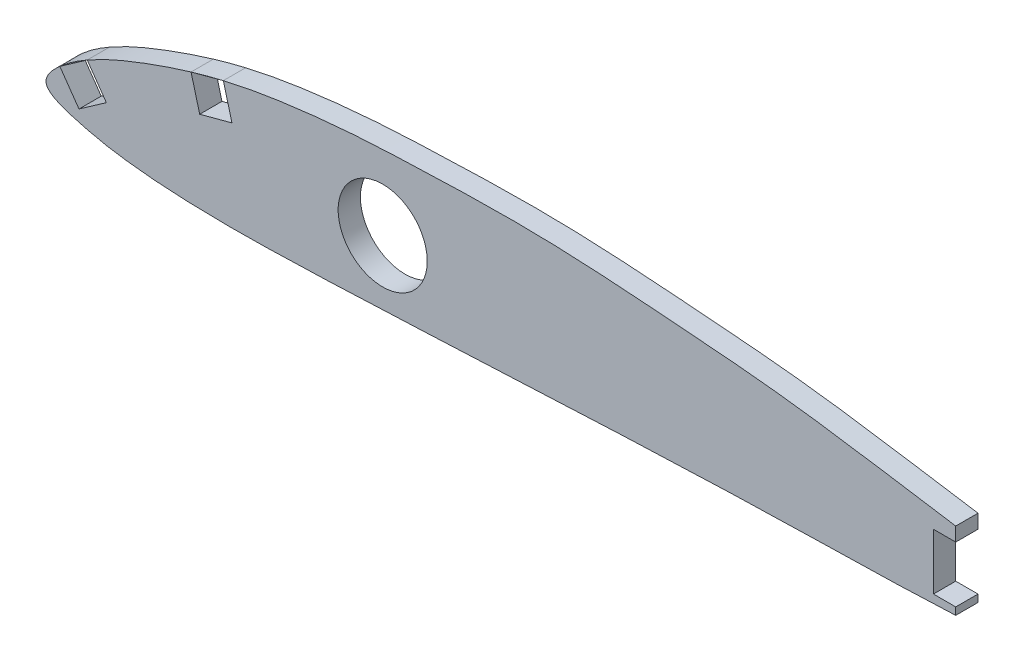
ISO-10303-21;
HEADER;
FILE_DESCRIPTION(('STEP AP214'),'2;1');
FILE_NAME('part.step','',(''),(''),'','','');
FILE_SCHEMA(('AUTOMOTIVE_DESIGN { 1 0 10303 214 1 1 1 1 }'));
ENDSEC;
DATA;
#1=APPLICATION_CONTEXT('core data for automotive mechanical design processes');
#2=APPLICATION_PROTOCOL_DEFINITION('international standard','automotive_design',2000,#1);
#3=PRODUCT_CONTEXT('',#1,'mechanical');
#4=PRODUCT('Part','Part','',(#3));
#5=PRODUCT_RELATED_PRODUCT_CATEGORY('part','',(#4));
#6=PRODUCT_DEFINITION_FORMATION('','',#4);
#7=PRODUCT_DEFINITION_CONTEXT('part definition',#1,'design');
#8=PRODUCT_DEFINITION('design','',#6,#7);
#9=PRODUCT_DEFINITION_SHAPE('','',#8);
#10=(LENGTH_UNIT() NAMED_UNIT(*) SI_UNIT(.MILLI.,.METRE.));
#11=(NAMED_UNIT(*) PLANE_ANGLE_UNIT() SI_UNIT($,.RADIAN.));
#12=(NAMED_UNIT(*) SI_UNIT($,.STERADIAN.) SOLID_ANGLE_UNIT());
#13=UNCERTAINTY_MEASURE_WITH_UNIT(LENGTH_MEASURE(1.E-05),#10,'distance_accuracy_value','');
#14=(GEOMETRIC_REPRESENTATION_CONTEXT(3) GLOBAL_UNCERTAINTY_ASSIGNED_CONTEXT((#13)) GLOBAL_UNIT_ASSIGNED_CONTEXT((#10,
#11,#12)) REPRESENTATION_CONTEXT('',''));
#15=CARTESIAN_POINT('',(0.,0.,0.));
#16=DIRECTION('',(0.,0.,1.));
#17=DIRECTION('',(1.,0.,0.));
#18=AXIS2_PLACEMENT_3D('',#15,#16,#17);
#19=CARTESIAN_POINT('',(0.,0.,0.));
#20=DIRECTION('',(0.,0.,-1.));
#21=DIRECTION('',(-1.,0.,0.));
#22=AXIS2_PLACEMENT_3D('',#19,#20,#21);
#23=PLANE('',#22);
#24=DIRECTION('',(0.,1.,0.));
#25=VECTOR('',#24,1.);
#26=CARTESIAN_POINT('',(129.677,0.,0.));
#27=LINE('',#26,#25);
#28=CARTESIAN_POINT('',(129.677,8.,0.));
#29=VERTEX_POINT('',#28);
#30=CARTESIAN_POINT('',(129.677,9.98356933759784,0.));
#31=VERTEX_POINT('',#30);
#32=EDGE_CURVE('E201',#29,#31,#27,.T.);
#33=ORIENTED_EDGE('',*,*,#32,.F.);
#34=DIRECTION('',(1.,0.,0.));
#35=VECTOR('',#34,1.);
#36=CARTESIAN_POINT('',(0.,8.,0.));
#37=LINE('',#36,#35);
#38=CARTESIAN_POINT('',(126.502,8.,0.));
#39=VERTEX_POINT('',#38);
#40=EDGE_CURVE('E64',#39,#29,#37,.T.);
#41=ORIENTED_EDGE('',*,*,#40,.F.);
#42=DIRECTION('',(0.,1.,0.));
#43=VECTOR('',#42,1.);
#44=CARTESIAN_POINT('',(126.502,0.,0.));
#45=LINE('',#44,#43);
#46=CARTESIAN_POINT('',(126.502,0.,0.));
#47=VERTEX_POINT('',#46);
#48=EDGE_CURVE('E190',#47,#39,#45,.T.);
#49=ORIENTED_EDGE('',*,*,#48,.F.);
#50=DIRECTION('',(-1.,0.,0.));
#51=VECTOR('',#50,1.);
#52=CARTESIAN_POINT('',(0.,1.79044563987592E-12,0.));
#53=LINE('',#52,#51);
#54=CARTESIAN_POINT('',(129.677,0.,0.));
#55=VERTEX_POINT('',#54);
#56=EDGE_CURVE('E133',#55,#47,#53,.T.);
#57=ORIENTED_EDGE('',*,*,#56,.F.);
#58=DIRECTION('',(0.,1.,0.));
#59=VECTOR('',#58,1.);
#60=CARTESIAN_POINT('',(129.677,4.98066869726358E-13,0.));
#61=LINE('',#60,#59);
#62=CARTESIAN_POINT('',(129.677,-1.04598156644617,0.));
#63=VERTEX_POINT('',#62);
#64=EDGE_CURVE('E196',#63,#55,#61,.T.);
#65=ORIENTED_EDGE('',*,*,#64,.F.);
#66=CARTESIAN_POINT('',(0.,0.,0.));
#67=CARTESIAN_POINT('',(-0.0484859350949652,0.941572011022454,0.));
#68=CARTESIAN_POINT('',(2.00754185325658,3.05522473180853,0.));
#69=CARTESIAN_POINT('',(4.92773606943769,5.1466904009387,0.));
#70=CARTESIAN_POINT('',(8.71252519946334,7.18476470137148,0.));
#71=CARTESIAN_POINT('',(15.9605352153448,10.1330490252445,0.));
#72=CARTESIAN_POINT('',(24.7528002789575,12.9382608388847,0.));
#73=CARTESIAN_POINT('',(35.1603546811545,14.6026126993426,0.));
#74=CARTESIAN_POINT('',(43.9813608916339,15.482919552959,0.));
#75=CARTESIAN_POINT('',(55.7229834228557,15.9750117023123,0.));
#76=CARTESIAN_POINT('',(70.4147838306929,16.391713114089,0.));
#77=CARTESIAN_POINT('',(87.9987880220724,15.1575928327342,0.));
#78=CARTESIAN_POINT('',(105.709747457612,13.7775565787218,0.));
#79=CARTESIAN_POINT('',(123.018830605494,11.0047737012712,0.));
#80=CARTESIAN_POINT('',(141.586795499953,8.1661867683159,0.));
#81=CARTESIAN_POINT('',(155.757184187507,4.83253050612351,0.));
#82=CARTESIAN_POINT('',(185.921370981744,-1.14244799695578,0.));
#83=CARTESIAN_POINT('',(146.891999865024,0.232259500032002,0.));
#84=CARTESIAN_POINT('',(129.919049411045,-1.3210353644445,0.));
#85=CARTESIAN_POINT('',(93.2790253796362,-1.89862445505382,0.));
#86=CARTESIAN_POINT('',(64.6376421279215,-3.45926123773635,0.));
#87=CARTESIAN_POINT('',(35.1487926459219,-4.74465237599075,0.));
#88=CARTESIAN_POINT('',(20.656598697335,-4.98228356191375,0.));
#89=CARTESIAN_POINT('',(9.98964050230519,-3.94915635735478,0.));
#90=CARTESIAN_POINT('',(4.55925202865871,-2.70750189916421,0.));
#91=CARTESIAN_POINT('',(0.0665353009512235,-1.29208144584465,0.));
#92=CARTESIAN_POINT('',(0.,0.,0.));
#93=B_SPLINE_CURVE_WITH_KNOTS('',3,(#66,#67,#68,#69,#70,#71,#72,#73,#74,#75,#76,#77,#78,#79,#80,
#81,#82,#83,#84,#85,#86,#87,#88,#89,#90,#91,#92),.UNSPECIFIED.,.T.,.F.,(4,1,1,1,1,1,1,1,1,1,1,1,
1,1,1,1,1,1,1,1,1,1,1,1,4),(0.,0.0105604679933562,0.0182111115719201,0.0322098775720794,
0.0455249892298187,0.0840694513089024,0.10897429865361,0.133649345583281,0.158232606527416,
0.207343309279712,0.25652270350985,0.30582635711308,0.355445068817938,0.40521420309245,
0.4553904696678,0.506006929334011,0.555121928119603,0.653369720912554,0.702490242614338,
0.849938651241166,0.899083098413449,0.948194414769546,0.972905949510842,0.985508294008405,1.),.UNSPECIFIED.);
#94=CARTESIAN_POINT('',(1.97152640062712,2.87928848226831,0.));
#95=VERTEX_POINT('',#94);
#96=EDGE_CURVE('E205',#63,#95,#93,.T.);
#97=ORIENTED_EDGE('',*,*,#96,.T.);
#98=DIRECTION('',(-0.573576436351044,0.819152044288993,0.));
#99=VECTOR('',#98,1.);
#100=CARTESIAN_POINT('',(2.67573714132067,1.87357131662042,0.));
#101=LINE('',#100,#99);
#102=CARTESIAN_POINT('',(4.70318417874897,-1.02192312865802,0.));
#103=VERTEX_POINT('',#102);
#104=EDGE_CURVE('E159',#103,#95,#101,.T.);
#105=ORIENTED_EDGE('',*,*,#104,.F.);
#106=DIRECTION('',(-0.819152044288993,-0.573576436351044,0.));
#107=VECTOR('',#106,1.);
#108=CARTESIAN_POINT('',(2.0274470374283,-2.89549444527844,0.));
#109=LINE('',#108,#107);
#110=CARTESIAN_POINT('',(8.60439578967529,1.70973464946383,0.));
#111=VERTEX_POINT('',#110);
#112=EDGE_CURVE('E248',#111,#103,#109,.T.);
#113=ORIENTED_EDGE('',*,*,#112,.F.);
#114=DIRECTION('',(0.573576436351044,-0.819152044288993,0.));
#115=VECTOR('',#114,1.);
#116=CARTESIAN_POINT('',(6.576948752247,4.60522909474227,0.));
#117=LINE('',#116,#115);
#118=CARTESIAN_POINT('',(5.87273801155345,5.61094626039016,0.));
#119=VERTEX_POINT('',#118);
#120=EDGE_CURVE('E179',#119,#111,#117,.T.);
#121=ORIENTED_EDGE('',*,*,#120,.F.);
#122=CARTESIAN_POINT('',(20.6768350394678,11.5336665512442,0.));
#123=VERTEX_POINT('',#122);
#124=EDGE_CURVE('E210',#119,#123,#93,.T.);
#125=ORIENTED_EDGE('',*,*,#124,.T.);
#126=DIRECTION('',(-0.258819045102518,0.965925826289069,0.));
#127=VECTOR('',#126,1.);
#128=CARTESIAN_POINT('',(22.1751663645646,5.94181791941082,0.));
#129=LINE('',#128,#127);
#130=CARTESIAN_POINT('',(21.9094607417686,6.93344480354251,0.));
#131=VERTEX_POINT('',#130);
#132=EDGE_CURVE('E237',#131,#123,#129,.T.);
#133=ORIENTED_EDGE('',*,*,#132,.F.);
#134=DIRECTION('',(-0.965925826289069,-0.258819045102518,0.));
#135=VECTOR('',#134,1.);
#136=CARTESIAN_POINT('',(-0.265705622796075,0.991626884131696,0.));
#137=LINE('',#136,#135);
#138=CARTESIAN_POINT('',(26.5096824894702,8.16607050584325,0.));
#139=VERTEX_POINT('',#138);
#140=EDGE_CURVE('E252',#139,#131,#137,.T.);
#141=ORIENTED_EDGE('',*,*,#140,.F.);
#142=DIRECTION('',(0.258819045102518,-0.965925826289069,0.));
#143=VECTOR('',#142,1.);
#144=CARTESIAN_POINT('',(26.7753881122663,7.17444362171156,0.));
#145=LINE('',#144,#143);
#146=CARTESIAN_POINT('',(25.2770567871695,12.7662922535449,0.));
#147=VERTEX_POINT('',#146);
#148=EDGE_CURVE('E261',#147,#139,#145,.T.);
#149=ORIENTED_EDGE('',*,*,#148,.F.);
#150=EDGE_CURVE('E211',#147,#31,#93,.T.);
#151=ORIENTED_EDGE('',*,*,#150,.T.);
#152=EDGE_LOOP('',(#33,#41,#49,#57,#65,#97,#105,#113,#121,#125,#133,#141,#149,#151));
#153=FACE_BOUND('',#152,.T.);
#154=CARTESIAN_POINT('',(47.995,5.,0.));
#155=DIRECTION('',(0.,0.,-1.));
#156=DIRECTION('',(-1.,0.,0.));
#157=AXIS2_PLACEMENT_3D('',#154,#155,#156);
#158=CIRCLE('',#157,6.35);
#159=CARTESIAN_POINT('',(41.645,5.,0.));
#160=VERTEX_POINT('',#159);
#161=EDGE_CURVE('E238',#160,#160,#158,.T.);
#162=ORIENTED_EDGE('',*,*,#161,.F.);
#163=EDGE_LOOP('',(#162));
#164=FACE_BOUND('',#163,.T.);
#165=ADVANCED_FACE('F44',(#153,#164),#23,.T.);
#166=CARTESIAN_POINT('',(0.,0.,3.175));
#167=DIRECTION('',(0.,0.,-1.));
#168=DIRECTION('',(-1.,0.,0.));
#169=AXIS2_PLACEMENT_3D('',#166,#167,#168);
#170=PLANE('',#169);
#171=CARTESIAN_POINT('',(47.995,5.,3.175));
#172=DIRECTION('',(0.,0.,1.));
#173=DIRECTION('',(1.,0.,0.));
#174=AXIS2_PLACEMENT_3D('',#171,#172,#173);
#175=CIRCLE('',#174,6.35);
#176=CARTESIAN_POINT('',(54.345,5.,3.175));
#177=VERTEX_POINT('',#176);
#178=EDGE_CURVE('E235',#177,#177,#175,.T.);
#179=ORIENTED_EDGE('',*,*,#178,.F.);
#180=EDGE_LOOP('',(#179));
#181=FACE_BOUND('',#180,.T.);
#182=DIRECTION('',(-1.,0.,0.));
#183=VECTOR('',#182,1.);
#184=CARTESIAN_POINT('',(126.502,8.,3.175));
#185=LINE('',#184,#183);
#186=CARTESIAN_POINT('',(129.677,8.,3.175));
#187=VERTEX_POINT('',#186);
#188=CARTESIAN_POINT('',(126.502,8.,3.175));
#189=VERTEX_POINT('',#188);
#190=EDGE_CURVE('E13',#187,#189,#185,.T.);
#191=ORIENTED_EDGE('',*,*,#190,.F.);
#192=DIRECTION('',(0.,-1.,0.));
#193=VECTOR('',#192,1.);
#194=CARTESIAN_POINT('',(129.677,23.6320828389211,3.175));
#195=LINE('',#194,#193);
#196=CARTESIAN_POINT('',(129.677,9.98356933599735,3.175));
#197=VERTEX_POINT('',#196);
#198=EDGE_CURVE('E200',#197,#187,#195,.T.);
#199=ORIENTED_EDGE('',*,*,#198,.F.);
#200=CARTESIAN_POINT('',(0.,0.,3.175));
#201=CARTESIAN_POINT('',(-0.0484859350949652,0.941572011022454,3.175));
#202=CARTESIAN_POINT('',(2.00754185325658,3.05522473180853,3.175));
#203=CARTESIAN_POINT('',(4.92773606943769,5.1466904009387,3.175));
#204=CARTESIAN_POINT('',(8.71252519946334,7.18476470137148,3.175));
#205=CARTESIAN_POINT('',(15.9605352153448,10.1330490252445,3.175));
#206=CARTESIAN_POINT('',(24.7528002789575,12.9382608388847,3.175));
#207=CARTESIAN_POINT('',(35.1603546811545,14.6026126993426,3.175));
#208=CARTESIAN_POINT('',(43.9813608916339,15.482919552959,3.175));
#209=CARTESIAN_POINT('',(55.7229834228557,15.9750117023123,3.175));
#210=CARTESIAN_POINT('',(70.4147838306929,16.391713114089,3.175));
#211=CARTESIAN_POINT('',(87.9987880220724,15.1575928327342,3.175));
#212=CARTESIAN_POINT('',(105.709747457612,13.7775565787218,3.175));
#213=CARTESIAN_POINT('',(123.018830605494,11.0047737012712,3.175));
#214=CARTESIAN_POINT('',(141.586795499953,8.1661867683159,3.175));
#215=CARTESIAN_POINT('',(155.757184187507,4.83253050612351,3.175));
#216=CARTESIAN_POINT('',(185.921370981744,-1.14244799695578,3.175));
#217=CARTESIAN_POINT('',(146.891999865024,0.232259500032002,3.175));
#218=CARTESIAN_POINT('',(129.919049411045,-1.3210353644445,3.175));
#219=CARTESIAN_POINT('',(93.2790253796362,-1.89862445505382,3.175));
#220=CARTESIAN_POINT('',(64.6376421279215,-3.45926123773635,3.175));
#221=CARTESIAN_POINT('',(35.1487926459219,-4.74465237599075,3.175));
#222=CARTESIAN_POINT('',(20.656598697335,-4.98228356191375,3.175));
#223=CARTESIAN_POINT('',(9.98964050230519,-3.94915635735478,3.175));
#224=CARTESIAN_POINT('',(4.55925202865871,-2.70750189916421,3.175));
#225=CARTESIAN_POINT('',(0.0665353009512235,-1.29208144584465,3.175));
#226=CARTESIAN_POINT('',(0.,0.,3.175));
#227=B_SPLINE_CURVE_WITH_KNOTS('',3,(#200,#201,#202,#203,#204,#205,#206,#207,#208,#209,#210,
#211,#212,#213,#214,#215,#216,#217,#218,#219,#220,#221,#222,#223,#224,#225,#226),.UNSPECIFIED.,
.T.,.F.,(4,1,1,1,1,1,1,1,1,1,1,1,1,1,1,1,1,1,1,1,1,1,1,1,4),(0.,0.0105604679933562,
0.0182111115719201,0.0322098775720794,0.0455249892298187,0.0840694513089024,0.10897429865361,
0.133649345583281,0.158232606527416,0.207343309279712,0.25652270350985,0.30582635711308,
0.355445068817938,0.40521420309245,0.4553904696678,0.506006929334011,0.555121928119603,
0.653369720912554,0.702490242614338,0.849938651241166,0.899083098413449,0.948194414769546,
0.972905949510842,0.985508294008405,1.),.UNSPECIFIED.);
#228=CARTESIAN_POINT('',(25.2770567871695,12.7662922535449,3.175));
#229=VERTEX_POINT('',#228);
#230=EDGE_CURVE('E172',#229,#197,#227,.T.);
#231=ORIENTED_EDGE('',*,*,#230,.F.);
#232=DIRECTION('',(-0.258819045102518,0.965925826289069,0.));
#233=VECTOR('',#232,1.);
#234=CARTESIAN_POINT('',(25.2770567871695,12.7662922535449,3.175));
#235=LINE('',#234,#233);
#236=CARTESIAN_POINT('',(26.5096824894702,8.16607050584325,3.175));
#237=VERTEX_POINT('',#236);
#238=EDGE_CURVE('E255',#237,#229,#235,.T.);
#239=ORIENTED_EDGE('',*,*,#238,.F.);
#240=DIRECTION('',(0.965925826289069,0.258819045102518,0.));
#241=VECTOR('',#240,1.);
#242=CARTESIAN_POINT('',(21.9094607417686,6.93344480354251,3.175));
#243=LINE('',#242,#241);
#244=CARTESIAN_POINT('',(21.9094607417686,6.93344480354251,3.175));
#245=VERTEX_POINT('',#244);
#246=EDGE_CURVE('E259',#245,#237,#243,.T.);
#247=ORIENTED_EDGE('',*,*,#246,.F.);
#248=DIRECTION('',(0.258819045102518,-0.965925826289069,0.));
#249=VECTOR('',#248,1.);
#250=CARTESIAN_POINT('',(20.6768350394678,11.5336665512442,3.175));
#251=LINE('',#250,#249);
#252=CARTESIAN_POINT('',(20.6768350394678,11.5336665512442,3.175));
#253=VERTEX_POINT('',#252);
#254=EDGE_CURVE('E264',#253,#245,#251,.T.);
#255=ORIENTED_EDGE('',*,*,#254,.F.);
#256=CARTESIAN_POINT('',(5.87273819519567,5.61094636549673,3.175));
#257=VERTEX_POINT('',#256);
#258=EDGE_CURVE('E173',#257,#253,#227,.T.);
#259=ORIENTED_EDGE('',*,*,#258,.F.);
#260=DIRECTION('',(-0.573576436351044,0.819152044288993,0.));
#261=VECTOR('',#260,1.);
#262=CARTESIAN_POINT('',(5.87273801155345,5.61094626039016,3.175));
#263=LINE('',#262,#261);
#264=CARTESIAN_POINT('',(8.60439578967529,1.70973464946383,3.175));
#265=VERTEX_POINT('',#264);
#266=EDGE_CURVE('E251',#265,#257,#263,.T.);
#267=ORIENTED_EDGE('',*,*,#266,.F.);
#268=DIRECTION('',(0.819152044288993,0.573576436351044,0.));
#269=VECTOR('',#268,1.);
#270=CARTESIAN_POINT('',(4.70318417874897,-1.02192312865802,3.175));
#271=LINE('',#270,#269);
#272=CARTESIAN_POINT('',(4.70318417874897,-1.02192312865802,3.175));
#273=VERTEX_POINT('',#272);
#274=EDGE_CURVE('E178',#273,#265,#271,.T.);
#275=ORIENTED_EDGE('',*,*,#274,.F.);
#276=DIRECTION('',(0.573576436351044,-0.819152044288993,0.));
#277=VECTOR('',#276,1.);
#278=CARTESIAN_POINT('',(1.97152640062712,2.87928848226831,3.175));
#279=LINE('',#278,#277);
#280=CARTESIAN_POINT('',(1.97152640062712,2.87928848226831,3.175));
#281=VERTEX_POINT('',#280);
#282=EDGE_CURVE('E156',#281,#273,#279,.T.);
#283=ORIENTED_EDGE('',*,*,#282,.F.);
#284=CARTESIAN_POINT('',(129.677,-1.04598156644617,3.175));
#285=VERTEX_POINT('',#284);
#286=EDGE_CURVE('E166',#285,#281,#227,.T.);
#287=ORIENTED_EDGE('',*,*,#286,.F.);
#288=DIRECTION('',(0.,-1.,0.));
#289=VECTOR('',#288,1.);
#290=CARTESIAN_POINT('',(129.677,0.,3.175));
#291=LINE('',#290,#289);
#292=CARTESIAN_POINT('',(129.677,0.,3.175));
#293=VERTEX_POINT('',#292);
#294=EDGE_CURVE('E195',#293,#285,#291,.T.);
#295=ORIENTED_EDGE('',*,*,#294,.F.);
#296=DIRECTION('',(1.,0.,0.));
#297=VECTOR('',#296,1.);
#298=CARTESIAN_POINT('',(126.502,0.,3.175));
#299=LINE('',#298,#297);
#300=CARTESIAN_POINT('',(126.502,0.,3.175));
#301=VERTEX_POINT('',#300);
#302=EDGE_CURVE('E192',#301,#293,#299,.T.);
#303=ORIENTED_EDGE('',*,*,#302,.F.);
#304=DIRECTION('',(0.,-1.,0.));
#305=VECTOR('',#304,1.);
#306=CARTESIAN_POINT('',(126.502,8.,3.175));
#307=LINE('',#306,#305);
#308=EDGE_CURVE('E189',#189,#301,#307,.T.);
#309=ORIENTED_EDGE('',*,*,#308,.F.);
#310=EDGE_LOOP('',(#191,#199,#231,#239,#247,#255,#259,#267,#275,#283,#287,#295,#303,#309));
#311=FACE_BOUND('',#310,.T.);
#312=ADVANCED_FACE('F175',(#181,#311),#170,.F.);
#313=DIRECTION('',(0.,0.,1.));
#314=VECTOR('',#313,1.);
#315=SURFACE_OF_LINEAR_EXTRUSION('',#93,#314);
#316=ORIENTED_EDGE('',*,*,#230,.T.);
#317=DIRECTION('',(0.,0.,1.));
#318=VECTOR('',#317,1.);
#319=CARTESIAN_POINT('',(129.677,9.98356933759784,0.));
#320=LINE('',#319,#318);
#321=EDGE_CURVE('E287',#197,#31,#320,.F.);
#322=ORIENTED_EDGE('',*,*,#321,.T.);
#323=ORIENTED_EDGE('',*,*,#150,.F.);
#324=DIRECTION('',(0.,0.,1.));
#325=VECTOR('',#324,1.);
#326=CARTESIAN_POINT('',(25.2770567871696,12.7662922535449,0.));
#327=LINE('',#326,#325);
#328=EDGE_CURVE('E212',#147,#229,#327,.T.);
#329=ORIENTED_EDGE('',*,*,#328,.T.);
#330=EDGE_LOOP('',(#316,#322,#323,#329));
#331=FACE_BOUND('',#330,.T.);
#332=ADVANCED_FACE('F222',(#331),#315,.F.);
#333=ORIENTED_EDGE('',*,*,#96,.F.);
#334=DIRECTION('',(0.,0.,1.));
#335=VECTOR('',#334,1.);
#336=CARTESIAN_POINT('',(129.677,-1.04598156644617,0.));
#337=LINE('',#336,#335);
#338=EDGE_CURVE('E168',#63,#285,#337,.T.);
#339=ORIENTED_EDGE('',*,*,#338,.T.);
#340=ORIENTED_EDGE('',*,*,#286,.T.);
#341=DIRECTION('',(0.,0.,1.));
#342=VECTOR('',#341,1.);
#343=CARTESIAN_POINT('',(1.97152640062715,2.87928848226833,0.));
#344=LINE('',#343,#342);
#345=EDGE_CURVE('E151',#95,#281,#344,.T.);
#346=ORIENTED_EDGE('',*,*,#345,.F.);
#347=EDGE_LOOP('',(#333,#339,#340,#346));
#348=FACE_BOUND('',#347,.T.);
#349=ADVANCED_FACE('F167',(#348),#315,.F.);
#350=ORIENTED_EDGE('',*,*,#124,.F.);
#351=DIRECTION('',(0.,0.,1.));
#352=VECTOR('',#351,1.);
#353=CARTESIAN_POINT('',(5.87273801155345,5.61094626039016,0.));
#354=LINE('',#353,#352);
#355=EDGE_CURVE('E171',#119,#257,#354,.T.);
#356=ORIENTED_EDGE('',*,*,#355,.T.);
#357=ORIENTED_EDGE('',*,*,#258,.T.);
#358=DIRECTION('',(0.,0.,1.));
#359=VECTOR('',#358,1.);
#360=CARTESIAN_POINT('',(20.6768350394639,11.5336665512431,0.));
#361=LINE('',#360,#359);
#362=EDGE_CURVE('E47',#123,#253,#361,.T.);
#363=ORIENTED_EDGE('',*,*,#362,.F.);
#364=EDGE_LOOP('',(#350,#356,#357,#363));
#365=FACE_BOUND('',#364,.T.);
#366=ADVANCED_FACE('F217',(#365),#315,.F.);
#367=CARTESIAN_POINT('',(47.995,5.,-6.825));
#368=DIRECTION('',(0.,0.,1.));
#369=DIRECTION('',(1.,0.,0.));
#370=AXIS2_PLACEMENT_3D('',#367,#368,#369);
#371=CYLINDRICAL_SURFACE('',#370,6.35);
#372=ORIENTED_EDGE('',*,*,#161,.T.);
#373=EDGE_LOOP('',(#372));
#374=FACE_BOUND('',#373,.T.);
#375=ORIENTED_EDGE('',*,*,#178,.T.);
#376=EDGE_LOOP('',(#375));
#377=FACE_BOUND('',#376,.T.);
#378=ADVANCED_FACE('F220',(#374,#377),#371,.F.);
#379=CARTESIAN_POINT('',(20.6768350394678,11.5336665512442,-6.825));
#380=DIRECTION('',(-0.965925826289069,-0.258819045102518,0.));
#381=DIRECTION('',(0.258819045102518,-0.965925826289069,0.));
#382=AXIS2_PLACEMENT_3D('',#379,#380,#381);
#383=PLANE('',#382);
#384=ORIENTED_EDGE('',*,*,#132,.T.);
#385=ORIENTED_EDGE('',*,*,#362,.T.);
#386=ORIENTED_EDGE('',*,*,#254,.T.);
#387=DIRECTION('',(0.,0.,1.));
#388=VECTOR('',#387,1.);
#389=CARTESIAN_POINT('',(21.9094607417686,6.93344480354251,-6.825));
#390=LINE('',#389,#388);
#391=EDGE_CURVE('E254',#131,#245,#390,.T.);
#392=ORIENTED_EDGE('',*,*,#391,.F.);
#393=EDGE_LOOP('',(#384,#385,#386,#392));
#394=FACE_BOUND('',#393,.T.);
#395=ADVANCED_FACE('F341',(#394),#383,.F.);
#396=CARTESIAN_POINT('',(25.2770567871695,12.7662922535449,-6.825));
#397=DIRECTION('',(0.965925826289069,0.258819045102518,0.));
#398=DIRECTION('',(-0.258819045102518,0.965925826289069,0.));
#399=AXIS2_PLACEMENT_3D('',#396,#397,#398);
#400=PLANE('',#399);
#401=ORIENTED_EDGE('',*,*,#148,.T.);
#402=DIRECTION('',(0.,0.,1.));
#403=VECTOR('',#402,1.);
#404=CARTESIAN_POINT('',(26.5096824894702,8.16607050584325,-6.825));
#405=LINE('',#404,#403);
#406=EDGE_CURVE('E263',#139,#237,#405,.T.);
#407=ORIENTED_EDGE('',*,*,#406,.T.);
#408=ORIENTED_EDGE('',*,*,#238,.T.);
#409=ORIENTED_EDGE('',*,*,#328,.F.);
#410=EDGE_LOOP('',(#401,#407,#408,#409));
#411=FACE_BOUND('',#410,.T.);
#412=ADVANCED_FACE('F335',(#411),#400,.F.);
#413=CARTESIAN_POINT('',(21.9094607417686,6.93344480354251,-6.825));
#414=DIRECTION('',(0.258819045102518,-0.965925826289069,0.));
#415=DIRECTION('',(0.965925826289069,0.258819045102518,0.));
#416=AXIS2_PLACEMENT_3D('',#413,#414,#415);
#417=PLANE('',#416);
#418=ORIENTED_EDGE('',*,*,#140,.T.);
#419=ORIENTED_EDGE('',*,*,#391,.T.);
#420=ORIENTED_EDGE('',*,*,#246,.T.);
#421=ORIENTED_EDGE('',*,*,#406,.F.);
#422=EDGE_LOOP('',(#418,#419,#420,#421));
#423=FACE_BOUND('',#422,.T.);
#424=ADVANCED_FACE('F337',(#423),#417,.F.);
#425=CARTESIAN_POINT('',(1.97152640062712,2.87928848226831,-6.825));
#426=DIRECTION('',(-0.819152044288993,-0.573576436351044,0.));
#427=DIRECTION('',(0.573576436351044,-0.819152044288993,0.));
#428=AXIS2_PLACEMENT_3D('',#425,#426,#427);
#429=PLANE('',#428);
#430=ORIENTED_EDGE('',*,*,#104,.T.);
#431=ORIENTED_EDGE('',*,*,#345,.T.);
#432=ORIENTED_EDGE('',*,*,#282,.T.);
#433=DIRECTION('',(0.,0.,1.));
#434=VECTOR('',#433,1.);
#435=CARTESIAN_POINT('',(4.70318417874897,-1.02192312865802,-6.825));
#436=LINE('',#435,#434);
#437=EDGE_CURVE('E250',#103,#273,#436,.T.);
#438=ORIENTED_EDGE('',*,*,#437,.F.);
#439=EDGE_LOOP('',(#430,#431,#432,#438));
#440=FACE_BOUND('',#439,.T.);
#441=ADVANCED_FACE('F153',(#440),#429,.F.);
#442=CARTESIAN_POINT('',(5.87273801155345,5.61094626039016,-6.825));
#443=DIRECTION('',(0.819152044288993,0.573576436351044,0.));
#444=DIRECTION('',(-0.573576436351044,0.819152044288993,0.));
#445=AXIS2_PLACEMENT_3D('',#442,#443,#444);
#446=PLANE('',#445);
#447=ORIENTED_EDGE('',*,*,#120,.T.);
#448=DIRECTION('',(0.,0.,1.));
#449=VECTOR('',#448,1.);
#450=CARTESIAN_POINT('',(8.60439578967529,1.70973464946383,-6.825));
#451=LINE('',#450,#449);
#452=EDGE_CURVE('E181',#111,#265,#451,.T.);
#453=ORIENTED_EDGE('',*,*,#452,.T.);
#454=ORIENTED_EDGE('',*,*,#266,.T.);
#455=ORIENTED_EDGE('',*,*,#355,.F.);
#456=EDGE_LOOP('',(#447,#453,#454,#455));
#457=FACE_BOUND('',#456,.T.);
#458=ADVANCED_FACE('F274',(#457),#446,.F.);
#459=CARTESIAN_POINT('',(4.70318417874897,-1.02192312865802,-6.825));
#460=DIRECTION('',(0.573576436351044,-0.819152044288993,0.));
#461=DIRECTION('',(0.819152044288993,0.573576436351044,0.));
#462=AXIS2_PLACEMENT_3D('',#459,#460,#461);
#463=PLANE('',#462);
#464=ORIENTED_EDGE('',*,*,#112,.T.);
#465=ORIENTED_EDGE('',*,*,#437,.T.);
#466=ORIENTED_EDGE('',*,*,#274,.T.);
#467=ORIENTED_EDGE('',*,*,#452,.F.);
#468=EDGE_LOOP('',(#464,#465,#466,#467));
#469=FACE_BOUND('',#468,.T.);
#470=ADVANCED_FACE('F301',(#469),#463,.F.);
#471=CARTESIAN_POINT('',(129.677,23.6320828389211,-6.825));
#472=DIRECTION('',(-1.,0.,0.));
#473=DIRECTION('',(0.,0.,1.));
#474=AXIS2_PLACEMENT_3D('',#471,#472,#473);
#475=PLANE('',#474);
#476=ORIENTED_EDGE('',*,*,#32,.T.);
#477=ORIENTED_EDGE('',*,*,#321,.F.);
#478=ORIENTED_EDGE('',*,*,#198,.T.);
#479=DIRECTION('',(0.,0.,1.));
#480=VECTOR('',#479,1.);
#481=CARTESIAN_POINT('',(129.677,8.,-6.825));
#482=LINE('',#481,#480);
#483=EDGE_CURVE('E52',#29,#187,#482,.T.);
#484=ORIENTED_EDGE('',*,*,#483,.F.);
#485=EDGE_LOOP('',(#476,#477,#478,#484));
#486=FACE_BOUND('',#485,.T.);
#487=ADVANCED_FACE('F319',(#486),#475,.F.);
#488=CARTESIAN_POINT('',(129.677,0.,-6.825));
#489=DIRECTION('',(-1.,0.,0.));
#490=DIRECTION('',(0.,-1.,0.));
#491=AXIS2_PLACEMENT_3D('',#488,#489,#490);
#492=PLANE('',#491);
#493=ORIENTED_EDGE('',*,*,#64,.T.);
#494=DIRECTION('',(0.,0.,1.));
#495=VECTOR('',#494,1.);
#496=CARTESIAN_POINT('',(129.677,0.,-6.825));
#497=LINE('',#496,#495);
#498=EDGE_CURVE('E193',#55,#293,#497,.T.);
#499=ORIENTED_EDGE('',*,*,#498,.T.);
#500=ORIENTED_EDGE('',*,*,#294,.T.);
#501=ORIENTED_EDGE('',*,*,#338,.F.);
#502=EDGE_LOOP('',(#493,#499,#500,#501));
#503=FACE_BOUND('',#502,.T.);
#504=ADVANCED_FACE('F223',(#503),#492,.F.);
#505=CARTESIAN_POINT('',(126.502,0.,-6.825));
#506=DIRECTION('',(0.,-1.,0.));
#507=DIRECTION('',(1.,0.,0.));
#508=AXIS2_PLACEMENT_3D('',#505,#506,#507);
#509=PLANE('',#508);
#510=ORIENTED_EDGE('',*,*,#56,.T.);
#511=DIRECTION('',(0.,0.,1.));
#512=VECTOR('',#511,1.);
#513=CARTESIAN_POINT('',(126.502,0.,-6.825));
#514=LINE('',#513,#512);
#515=EDGE_CURVE('E127',#47,#301,#514,.T.);
#516=ORIENTED_EDGE('',*,*,#515,.T.);
#517=ORIENTED_EDGE('',*,*,#302,.T.);
#518=ORIENTED_EDGE('',*,*,#498,.F.);
#519=EDGE_LOOP('',(#510,#516,#517,#518));
#520=FACE_BOUND('',#519,.T.);
#521=ADVANCED_FACE('F305',(#520),#509,.F.);
#522=CARTESIAN_POINT('',(126.502,8.,-6.825));
#523=DIRECTION('',(-1.,0.,0.));
#524=DIRECTION('',(0.,0.,1.));
#525=AXIS2_PLACEMENT_3D('',#522,#523,#524);
#526=PLANE('',#525);
#527=ORIENTED_EDGE('',*,*,#48,.T.);
#528=DIRECTION('',(0.,0.,1.));
#529=VECTOR('',#528,1.);
#530=CARTESIAN_POINT('',(126.502,8.,-6.825));
#531=LINE('',#530,#529);
#532=EDGE_CURVE('E187',#39,#189,#531,.T.);
#533=ORIENTED_EDGE('',*,*,#532,.T.);
#534=ORIENTED_EDGE('',*,*,#308,.T.);
#535=ORIENTED_EDGE('',*,*,#515,.F.);
#536=EDGE_LOOP('',(#527,#533,#534,#535));
#537=FACE_BOUND('',#536,.T.);
#538=ADVANCED_FACE('F310',(#537),#526,.F.);
#539=CARTESIAN_POINT('',(126.502,8.,-6.825));
#540=DIRECTION('',(0.,1.,0.));
#541=DIRECTION('',(0.,0.,1.));
#542=AXIS2_PLACEMENT_3D('',#539,#540,#541);
#543=PLANE('',#542);
#544=ORIENTED_EDGE('',*,*,#40,.T.);
#545=ORIENTED_EDGE('',*,*,#483,.T.);
#546=ORIENTED_EDGE('',*,*,#190,.T.);
#547=ORIENTED_EDGE('',*,*,#532,.F.);
#548=EDGE_LOOP('',(#544,#545,#546,#547));
#549=FACE_BOUND('',#548,.T.);
#550=ADVANCED_FACE('F311',(#549),#543,.F.);
#551=CLOSED_SHELL('',(#165,#312,#332,#349,#366,#378,#395,#412,#424,#441,#458,#470,#487,#504,
#521,#538,#550));
#552=MANIFOLD_SOLID_BREP('B2',#551);
#553=CARTESIAN_POINT('',(0.,0.,0.));
#554=CARTESIAN_POINT('',(-0.0484859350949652,0.941572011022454,0.));
#555=CARTESIAN_POINT('',(2.00754185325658,3.05522473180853,0.));
#556=CARTESIAN_POINT('',(4.92773606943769,5.1466904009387,0.));
#557=CARTESIAN_POINT('',(8.71252519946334,7.18476470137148,0.));
#558=CARTESIAN_POINT('',(15.9605352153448,10.1330490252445,0.));
#559=CARTESIAN_POINT('',(24.7528002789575,12.9382608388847,0.));
#560=CARTESIAN_POINT('',(35.1603546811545,14.6026126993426,0.));
#561=CARTESIAN_POINT('',(43.9813608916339,15.482919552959,0.));
#562=CARTESIAN_POINT('',(55.7229834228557,15.9750117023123,0.));
#563=CARTESIAN_POINT('',(70.4147838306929,16.391713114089,0.));
#564=CARTESIAN_POINT('',(87.9987880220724,15.1575928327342,0.));
#565=CARTESIAN_POINT('',(105.709747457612,13.7775565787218,0.));
#566=CARTESIAN_POINT('',(123.018830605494,11.0047737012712,0.));
#567=CARTESIAN_POINT('',(141.586795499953,8.1661867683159,0.));
#568=CARTESIAN_POINT('',(155.757184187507,4.83253050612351,0.));
#569=CARTESIAN_POINT('',(185.921370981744,-1.14244799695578,0.));
#570=CARTESIAN_POINT('',(146.891999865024,0.232259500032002,0.));
#571=CARTESIAN_POINT('',(129.919049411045,-1.3210353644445,0.));
#572=CARTESIAN_POINT('',(93.2790253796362,-1.89862445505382,0.));
#573=CARTESIAN_POINT('',(64.6376421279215,-3.45926123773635,0.));
#574=CARTESIAN_POINT('',(35.1487926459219,-4.74465237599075,0.));
#575=CARTESIAN_POINT('',(20.656598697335,-4.98228356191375,0.));
#576=CARTESIAN_POINT('',(9.98964050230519,-3.94915635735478,0.));
#577=CARTESIAN_POINT('',(4.55925202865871,-2.70750189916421,0.));
#578=CARTESIAN_POINT('',(0.0665353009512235,-1.29208144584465,0.));
#579=CARTESIAN_POINT('',(0.,0.,0.));
#580=B_SPLINE_CURVE_WITH_KNOTS('',3,(#553,#554,#555,#556,#557,#558,#559,#560,#561,#562,#563,
#564,#565,#566,#567,#568,#569,#570,#571,#572,#573,#574,#575,#576,#577,#578,#579),.UNSPECIFIED.,
.T.,.F.,(4,1,1,1,1,1,1,1,1,1,1,1,1,1,1,1,1,1,1,1,1,1,1,1,4),(0.,0.0105604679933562,
0.0182111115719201,0.0322098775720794,0.0455249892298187,0.0840694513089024,0.10897429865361,
0.133649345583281,0.158232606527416,0.207343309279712,0.25652270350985,0.30582635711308,
0.355445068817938,0.40521420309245,0.4553904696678,0.506006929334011,0.555121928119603,
0.653369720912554,0.702490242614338,0.849938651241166,0.899083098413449,0.948194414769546,
0.972905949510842,0.985508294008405,1.),.UNSPECIFIED.);
#581=DIRECTION('',(0.,0.,1.));
#582=VECTOR('',#581,1.);
#583=SURFACE_OF_LINEAR_EXTRUSION('',#580,#582);
#584=CARTESIAN_POINT('',(20.6768350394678,11.5336665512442,0.));
#585=VERTEX_POINT('',#584);
#586=CARTESIAN_POINT('',(25.2770567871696,12.7662922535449,0.));
#587=VERTEX_POINT('',#586);
#588=EDGE_CURVE('E494',#585,#587,#580,.T.);
#589=ORIENTED_EDGE('',*,*,#588,.F.);
#590=DIRECTION('',(0.,0.,1.));
#591=VECTOR('',#590,1.);
#592=CARTESIAN_POINT('',(20.6768350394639,11.5336665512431,0.));
#593=LINE('',#592,#591);
#594=CARTESIAN_POINT('',(20.6768350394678,11.5336665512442,3.175));
#595=VERTEX_POINT('',#594);
#596=EDGE_CURVE('E481',#585,#595,#593,.T.);
#597=ORIENTED_EDGE('',*,*,#596,.T.);
#598=CARTESIAN_POINT('',(0.,0.,3.175));
#599=CARTESIAN_POINT('',(-0.0484859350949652,0.941572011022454,3.175));
#600=CARTESIAN_POINT('',(2.00754185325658,3.05522473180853,3.175));
#601=CARTESIAN_POINT('',(4.92773606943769,5.1466904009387,3.175));
#602=CARTESIAN_POINT('',(8.71252519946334,7.18476470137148,3.175));
#603=CARTESIAN_POINT('',(15.9605352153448,10.1330490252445,3.175));
#604=CARTESIAN_POINT('',(24.7528002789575,12.9382608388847,3.175));
#605=CARTESIAN_POINT('',(35.1603546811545,14.6026126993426,3.175));
#606=CARTESIAN_POINT('',(43.9813608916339,15.482919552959,3.175));
#607=CARTESIAN_POINT('',(55.7229834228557,15.9750117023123,3.175));
#608=CARTESIAN_POINT('',(70.4147838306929,16.391713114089,3.175));
#609=CARTESIAN_POINT('',(87.9987880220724,15.1575928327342,3.175));
#610=CARTESIAN_POINT('',(105.709747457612,13.7775565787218,3.175));
#611=CARTESIAN_POINT('',(123.018830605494,11.0047737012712,3.175));
#612=CARTESIAN_POINT('',(141.586795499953,8.1661867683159,3.175));
#613=CARTESIAN_POINT('',(155.757184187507,4.83253050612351,3.175));
#614=CARTESIAN_POINT('',(185.921370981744,-1.14244799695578,3.175));
#615=CARTESIAN_POINT('',(146.891999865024,0.232259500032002,3.175));
#616=CARTESIAN_POINT('',(129.919049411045,-1.3210353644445,3.175));
#617=CARTESIAN_POINT('',(93.2790253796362,-1.89862445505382,3.175));
#618=CARTESIAN_POINT('',(64.6376421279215,-3.45926123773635,3.175));
#619=CARTESIAN_POINT('',(35.1487926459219,-4.74465237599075,3.175));
#620=CARTESIAN_POINT('',(20.656598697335,-4.98228356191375,3.175));
#621=CARTESIAN_POINT('',(9.98964050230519,-3.94915635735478,3.175));
#622=CARTESIAN_POINT('',(4.55925202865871,-2.70750189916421,3.175));
#623=CARTESIAN_POINT('',(0.0665353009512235,-1.29208144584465,3.175));
#624=CARTESIAN_POINT('',(0.,0.,3.175));
#625=B_SPLINE_CURVE_WITH_KNOTS('',3,(#598,#599,#600,#601,#602,#603,#604,#605,#606,#607,#608,
#609,#610,#611,#612,#613,#614,#615,#616,#617,#618,#619,#620,#621,#622,#623,#624),.UNSPECIFIED.,
.T.,.F.,(4,1,1,1,1,1,1,1,1,1,1,1,1,1,1,1,1,1,1,1,1,1,1,1,4),(0.,0.0105604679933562,
0.0182111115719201,0.0322098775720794,0.0455249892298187,0.0840694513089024,0.10897429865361,
0.133649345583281,0.158232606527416,0.207343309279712,0.25652270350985,0.30582635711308,
0.355445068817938,0.40521420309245,0.4553904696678,0.506006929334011,0.555121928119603,
0.653369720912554,0.702490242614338,0.849938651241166,0.899083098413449,0.948194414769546,
0.972905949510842,0.985508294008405,1.),.UNSPECIFIED.);
#626=CARTESIAN_POINT('',(25.2770567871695,12.7662922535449,3.175));
#627=VERTEX_POINT('',#626);
#628=EDGE_CURVE('E466',#595,#627,#625,.T.);
#629=ORIENTED_EDGE('',*,*,#628,.T.);
#630=DIRECTION('',(0.,0.,1.));
#631=VECTOR('',#630,1.);
#632=CARTESIAN_POINT('',(25.2770567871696,12.7662922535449,0.));
#633=LINE('',#632,#631);
#634=EDGE_CURVE('E474',#587,#627,#633,.T.);
#635=ORIENTED_EDGE('',*,*,#634,.F.);
#636=EDGE_LOOP('',(#589,#597,#629,#635));
#637=FACE_BOUND('',#636,.T.);
#638=ADVANCED_FACE('F462',(#637),#583,.F.);
#639=CARTESIAN_POINT('',(0.,0.,3.175));
#640=DIRECTION('',(0.,0.,-1.));
#641=DIRECTION('',(-1.,0.,0.));
#642=AXIS2_PLACEMENT_3D('',#639,#640,#641);
#643=PLANE('',#642);
#644=ORIENTED_EDGE('',*,*,#628,.F.);
#645=DIRECTION('',(-0.965925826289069,-0.258819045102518,0.));
#646=VECTOR('',#645,1.);
#647=CARTESIAN_POINT('',(20.6768350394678,11.5336665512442,3.175));
#648=LINE('',#647,#646);
#649=EDGE_CURVE('E42',#627,#595,#648,.T.);
#650=ORIENTED_EDGE('',*,*,#649,.F.);
#651=EDGE_LOOP('',(#644,#650));
#652=FACE_BOUND('',#651,.T.);
#653=ADVANCED_FACE('F509',(#652),#643,.F.);
#654=CARTESIAN_POINT('',(0.,0.,0.));
#655=DIRECTION('',(0.,0.,-1.));
#656=DIRECTION('',(-1.,0.,0.));
#657=AXIS2_PLACEMENT_3D('',#654,#655,#656);
#658=PLANE('',#657);
#659=DIRECTION('',(0.965925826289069,0.258819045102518,0.));
#660=VECTOR('',#659,1.);
#661=CARTESIAN_POINT('',(-1.49833132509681,5.59184863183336,0.));
#662=LINE('',#661,#660);
#663=EDGE_CURVE('E488',#585,#587,#662,.T.);
#664=ORIENTED_EDGE('',*,*,#663,.F.);
#665=ORIENTED_EDGE('',*,*,#588,.T.);
#666=EDGE_LOOP('',(#664,#665));
#667=FACE_BOUND('',#666,.T.);
#668=ADVANCED_FACE('F464',(#667),#658,.T.);
#669=CARTESIAN_POINT('',(20.6768350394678,11.5336665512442,-6.825));
#670=DIRECTION('',(-0.258819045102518,0.965925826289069,0.));
#671=DIRECTION('',(-0.965925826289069,-0.258819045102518,0.));
#672=AXIS2_PLACEMENT_3D('',#669,#670,#671);
#673=PLANE('',#672);
#674=ORIENTED_EDGE('',*,*,#663,.T.);
#675=ORIENTED_EDGE('',*,*,#634,.T.);
#676=ORIENTED_EDGE('',*,*,#649,.T.);
#677=ORIENTED_EDGE('',*,*,#596,.F.);
#678=EDGE_LOOP('',(#674,#675,#676,#677));
#679=FACE_BOUND('',#678,.T.);
#680=ADVANCED_FACE('F490',(#679),#673,.F.);
#681=CLOSED_SHELL('',(#638,#653,#668,#680));
#682=MANIFOLD_SOLID_BREP('B7',#681);
#683=CARTESIAN_POINT('',(0.,0.,0.));
#684=CARTESIAN_POINT('',(-0.0484859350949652,0.941572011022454,0.));
#685=CARTESIAN_POINT('',(2.00754185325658,3.05522473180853,0.));
#686=CARTESIAN_POINT('',(4.92773606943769,5.1466904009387,0.));
#687=CARTESIAN_POINT('',(8.71252519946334,7.18476470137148,0.));
#688=CARTESIAN_POINT('',(15.9605352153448,10.1330490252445,0.));
#689=CARTESIAN_POINT('',(24.7528002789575,12.9382608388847,0.));
#690=CARTESIAN_POINT('',(35.1603546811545,14.6026126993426,0.));
#691=CARTESIAN_POINT('',(43.9813608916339,15.482919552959,0.));
#692=CARTESIAN_POINT('',(55.7229834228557,15.9750117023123,0.));
#693=CARTESIAN_POINT('',(70.4147838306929,16.391713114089,0.));
#694=CARTESIAN_POINT('',(87.9987880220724,15.1575928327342,0.));
#695=CARTESIAN_POINT('',(105.709747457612,13.7775565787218,0.));
#696=CARTESIAN_POINT('',(123.018830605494,11.0047737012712,0.));
#697=CARTESIAN_POINT('',(141.586795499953,8.1661867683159,0.));
#698=CARTESIAN_POINT('',(155.757184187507,4.83253050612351,0.));
#699=CARTESIAN_POINT('',(185.921370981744,-1.14244799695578,0.));
#700=CARTESIAN_POINT('',(146.891999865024,0.232259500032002,0.));
#701=CARTESIAN_POINT('',(129.919049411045,-1.3210353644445,0.));
#702=CARTESIAN_POINT('',(93.2790253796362,-1.89862445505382,0.));
#703=CARTESIAN_POINT('',(64.6376421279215,-3.45926123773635,0.));
#704=CARTESIAN_POINT('',(35.1487926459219,-4.74465237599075,0.));
#705=CARTESIAN_POINT('',(20.656598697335,-4.98228356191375,0.));
#706=CARTESIAN_POINT('',(9.98964050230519,-3.94915635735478,0.));
#707=CARTESIAN_POINT('',(4.55925202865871,-2.70750189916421,0.));
#708=CARTESIAN_POINT('',(0.0665353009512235,-1.29208144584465,0.));
#709=CARTESIAN_POINT('',(0.,0.,0.));
#710=B_SPLINE_CURVE_WITH_KNOTS('',3,(#683,#684,#685,#686,#687,#688,#689,#690,#691,#692,#693,
#694,#695,#696,#697,#698,#699,#700,#701,#702,#703,#704,#705,#706,#707,#708,#709),.UNSPECIFIED.,
.T.,.F.,(4,1,1,1,1,1,1,1,1,1,1,1,1,1,1,1,1,1,1,1,1,1,1,1,4),(0.,0.0105604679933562,
0.0182111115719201,0.0322098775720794,0.0455249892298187,0.0840694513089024,0.10897429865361,
0.133649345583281,0.158232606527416,0.207343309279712,0.25652270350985,0.30582635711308,
0.355445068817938,0.40521420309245,0.4553904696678,0.506006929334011,0.555121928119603,
0.653369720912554,0.702490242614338,0.849938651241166,0.899083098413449,0.948194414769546,
0.972905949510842,0.985508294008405,1.),.UNSPECIFIED.);
#711=DIRECTION('',(0.,0.,1.));
#712=VECTOR('',#711,1.);
#713=SURFACE_OF_LINEAR_EXTRUSION('',#710,#712);
#714=CARTESIAN_POINT('',(1.97152640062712,2.87928848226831,0.));
#715=VERTEX_POINT('',#714);
#716=CARTESIAN_POINT('',(5.87273801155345,5.61094626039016,0.));
#717=VERTEX_POINT('',#716);
#718=EDGE_CURVE('E576',#715,#717,#710,.T.);
#719=ORIENTED_EDGE('',*,*,#718,.F.);
#720=DIRECTION('',(0.,0.,1.));
#721=VECTOR('',#720,1.);
#722=CARTESIAN_POINT('',(1.97152640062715,2.87928848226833,0.));
#723=LINE('',#722,#721);
#724=CARTESIAN_POINT('',(1.97152640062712,2.87928848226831,3.175));
#725=VERTEX_POINT('',#724);
#726=EDGE_CURVE('E460',#715,#725,#723,.T.);
#727=ORIENTED_EDGE('',*,*,#726,.T.);
#728=CARTESIAN_POINT('',(0.,0.,3.175));
#729=CARTESIAN_POINT('',(-0.0484859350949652,0.941572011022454,3.175));
#730=CARTESIAN_POINT('',(2.00754185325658,3.05522473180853,3.175));
#731=CARTESIAN_POINT('',(4.92773606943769,5.1466904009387,3.175));
#732=CARTESIAN_POINT('',(8.71252519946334,7.18476470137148,3.175));
#733=CARTESIAN_POINT('',(15.9605352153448,10.1330490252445,3.175));
#734=CARTESIAN_POINT('',(24.7528002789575,12.9382608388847,3.175));
#735=CARTESIAN_POINT('',(35.1603546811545,14.6026126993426,3.175));
#736=CARTESIAN_POINT('',(43.9813608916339,15.482919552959,3.175));
#737=CARTESIAN_POINT('',(55.7229834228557,15.9750117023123,3.175));
#738=CARTESIAN_POINT('',(70.4147838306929,16.391713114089,3.175));
#739=CARTESIAN_POINT('',(87.9987880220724,15.1575928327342,3.175));
#740=CARTESIAN_POINT('',(105.709747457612,13.7775565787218,3.175));
#741=CARTESIAN_POINT('',(123.018830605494,11.0047737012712,3.175));
#742=CARTESIAN_POINT('',(141.586795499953,8.1661867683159,3.175));
#743=CARTESIAN_POINT('',(155.757184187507,4.83253050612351,3.175));
#744=CARTESIAN_POINT('',(185.921370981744,-1.14244799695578,3.175));
#745=CARTESIAN_POINT('',(146.891999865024,0.232259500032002,3.175));
#746=CARTESIAN_POINT('',(129.919049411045,-1.3210353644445,3.175));
#747=CARTESIAN_POINT('',(93.2790253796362,-1.89862445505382,3.175));
#748=CARTESIAN_POINT('',(64.6376421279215,-3.45926123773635,3.175));
#749=CARTESIAN_POINT('',(35.1487926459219,-4.74465237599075,3.175));
#750=CARTESIAN_POINT('',(20.656598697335,-4.98228356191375,3.175));
#751=CARTESIAN_POINT('',(9.98964050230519,-3.94915635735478,3.175));
#752=CARTESIAN_POINT('',(4.55925202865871,-2.70750189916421,3.175));
#753=CARTESIAN_POINT('',(0.0665353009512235,-1.29208144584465,3.175));
#754=CARTESIAN_POINT('',(0.,0.,3.175));
#755=B_SPLINE_CURVE_WITH_KNOTS('',3,(#728,#729,#730,#731,#732,#733,#734,#735,#736,#737,#738,
#739,#740,#741,#742,#743,#744,#745,#746,#747,#748,#749,#750,#751,#752,#753,#754),.UNSPECIFIED.,
.T.,.F.,(4,1,1,1,1,1,1,1,1,1,1,1,1,1,1,1,1,1,1,1,1,1,1,1,4),(0.,0.0105604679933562,
0.0182111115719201,0.0322098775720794,0.0455249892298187,0.0840694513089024,0.10897429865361,
0.133649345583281,0.158232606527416,0.207343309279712,0.25652270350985,0.30582635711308,
0.355445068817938,0.40521420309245,0.4553904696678,0.506006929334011,0.555121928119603,
0.653369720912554,0.702490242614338,0.849938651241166,0.899083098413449,0.948194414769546,
0.972905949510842,0.985508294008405,1.),.UNSPECIFIED.);
#756=CARTESIAN_POINT('',(5.87273801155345,5.61094626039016,3.175));
#757=VERTEX_POINT('',#756);
#758=EDGE_CURVE('E574',#725,#757,#755,.T.);
#759=ORIENTED_EDGE('',*,*,#758,.T.);
#760=DIRECTION('',(0.,0.,1.));
#761=VECTOR('',#760,1.);
#762=CARTESIAN_POINT('',(5.87273801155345,5.61094626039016,0.));
#763=LINE('',#762,#761);
#764=EDGE_CURVE('E552',#717,#757,#763,.T.);
#765=ORIENTED_EDGE('',*,*,#764,.F.);
#766=EDGE_LOOP('',(#719,#727,#759,#765));
#767=FACE_BOUND('',#766,.T.);
#768=ADVANCED_FACE('F544',(#767),#713,.F.);
#769=CARTESIAN_POINT('',(0.,0.,3.175));
#770=DIRECTION('',(0.,0.,-1.));
#771=DIRECTION('',(-1.,0.,0.));
#772=AXIS2_PLACEMENT_3D('',#769,#770,#771);
#773=PLANE('',#772);
#774=ORIENTED_EDGE('',*,*,#758,.F.);
#775=DIRECTION('',(-0.819152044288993,-0.573576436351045,0.));
#776=VECTOR('',#775,1.);
#777=CARTESIAN_POINT('',(1.97152640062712,2.87928848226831,3.175));
#778=LINE('',#777,#776);
#779=EDGE_CURVE('E567',#757,#725,#778,.T.);
#780=ORIENTED_EDGE('',*,*,#779,.F.);
#781=EDGE_LOOP('',(#774,#780));
#782=FACE_BOUND('',#781,.T.);
#783=ADVANCED_FACE('F578',(#782),#773,.F.);
#784=CARTESIAN_POINT('',(0.,0.,0.));
#785=DIRECTION('',(0.,0.,-1.));
#786=DIRECTION('',(-1.,0.,0.));
#787=AXIS2_PLACEMENT_3D('',#784,#785,#786);
#788=PLANE('',#787);
#789=DIRECTION('',(0.819152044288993,0.573576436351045,0.));
#790=VECTOR('',#789,1.);
#791=CARTESIAN_POINT('',(-0.70421074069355,1.00571716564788,0.));
#792=LINE('',#791,#790);
#793=EDGE_CURVE('E571',#715,#717,#792,.T.);
#794=ORIENTED_EDGE('',*,*,#793,.F.);
#795=ORIENTED_EDGE('',*,*,#718,.T.);
#796=EDGE_LOOP('',(#794,#795));
#797=FACE_BOUND('',#796,.T.);
#798=ADVANCED_FACE('F546',(#797),#788,.T.);
#799=CARTESIAN_POINT('',(1.97152640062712,2.87928848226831,-6.825));
#800=DIRECTION('',(-0.573576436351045,0.819152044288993,0.));
#801=DIRECTION('',(-0.819152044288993,-0.573576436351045,0.));
#802=AXIS2_PLACEMENT_3D('',#799,#800,#801);
#803=PLANE('',#802);
#804=ORIENTED_EDGE('',*,*,#793,.T.);
#805=ORIENTED_EDGE('',*,*,#764,.T.);
#806=ORIENTED_EDGE('',*,*,#779,.T.);
#807=ORIENTED_EDGE('',*,*,#726,.F.);
#808=EDGE_LOOP('',(#804,#805,#806,#807));
#809=FACE_BOUND('',#808,.T.);
#810=ADVANCED_FACE('F568',(#809),#803,.F.);
#811=CLOSED_SHELL('',(#768,#783,#798,#810));
#812=MANIFOLD_SOLID_BREP('B36',#811);
#813=ADVANCED_BREP_SHAPE_REPRESENTATION('',(#18,#552,#682,#812),#14);
#814=SHAPE_DEFINITION_REPRESENTATION(#9,#813);
ENDSEC;
END-ISO-10303-21;
